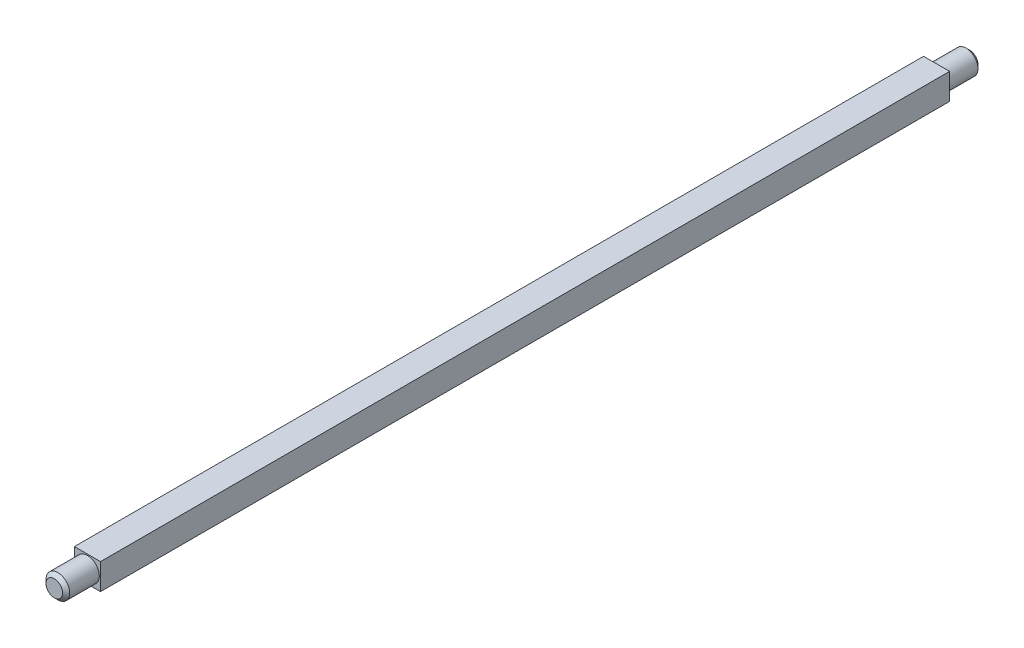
ISO-10303-21;
HEADER;
FILE_DESCRIPTION(('STEP AP214'),'2;1');
FILE_NAME('part.step','',(''),(''),'','','');
FILE_SCHEMA(('AUTOMOTIVE_DESIGN { 1 0 10303 214 1 1 1 1 }'));
ENDSEC;
DATA;
#1=APPLICATION_CONTEXT('core data for automotive mechanical design processes');
#2=APPLICATION_PROTOCOL_DEFINITION('international standard','automotive_design',2000,#1);
#3=PRODUCT_CONTEXT('',#1,'mechanical');
#4=PRODUCT('Part','Part','',(#3));
#5=PRODUCT_RELATED_PRODUCT_CATEGORY('part','',(#4));
#6=PRODUCT_DEFINITION_FORMATION('','',#4);
#7=PRODUCT_DEFINITION_CONTEXT('part definition',#1,'design');
#8=PRODUCT_DEFINITION('design','',#6,#7);
#9=PRODUCT_DEFINITION_SHAPE('','',#8);
#10=(LENGTH_UNIT() NAMED_UNIT(*) SI_UNIT(.MILLI.,.METRE.));
#11=(NAMED_UNIT(*) PLANE_ANGLE_UNIT() SI_UNIT($,.RADIAN.));
#12=(NAMED_UNIT(*) SI_UNIT($,.STERADIAN.) SOLID_ANGLE_UNIT());
#13=UNCERTAINTY_MEASURE_WITH_UNIT(LENGTH_MEASURE(1.E-05),#10,'distance_accuracy_value','');
#14=(GEOMETRIC_REPRESENTATION_CONTEXT(3) GLOBAL_UNCERTAINTY_ASSIGNED_CONTEXT((#13)) GLOBAL_UNIT_ASSIGNED_CONTEXT((#10,
#11,#12)) REPRESENTATION_CONTEXT('',''));
#15=CARTESIAN_POINT('',(0.,0.,0.));
#16=DIRECTION('',(0.,0.,1.));
#17=DIRECTION('',(1.,0.,0.));
#18=AXIS2_PLACEMENT_3D('',#15,#16,#17);
#19=CARTESIAN_POINT('',(5.5,-5.5,-179.25));
#20=DIRECTION('',(1.,0.,0.));
#21=DIRECTION('',(0.,0.,-1.));
#22=AXIS2_PLACEMENT_3D('',#19,#20,#21);
#23=PLANE('',#22);
#24=DIRECTION('',(0.,0.,1.));
#25=VECTOR('',#24,1.);
#26=CARTESIAN_POINT('',(5.5,5.5,-179.25));
#27=LINE('',#26,#25);
#28=CARTESIAN_POINT('',(5.5,5.5,-179.25));
#29=VERTEX_POINT('',#28);
#30=CARTESIAN_POINT('',(5.5,5.5,179.25));
#31=VERTEX_POINT('',#30);
#32=EDGE_CURVE('E89',#29,#31,#27,.T.);
#33=ORIENTED_EDGE('',*,*,#32,.T.);
#34=DIRECTION('',(0.,1.,0.));
#35=VECTOR('',#34,1.);
#36=CARTESIAN_POINT('',(5.5,-5.5,179.25));
#37=LINE('',#36,#35);
#38=CARTESIAN_POINT('',(5.5,-5.5,179.25));
#39=VERTEX_POINT('',#38);
#40=EDGE_CURVE('E92',#39,#31,#37,.T.);
#41=ORIENTED_EDGE('',*,*,#40,.F.);
#42=DIRECTION('',(0.,0.,1.));
#43=VECTOR('',#42,1.);
#44=CARTESIAN_POINT('',(5.5,-5.5,-179.25));
#45=LINE('',#44,#43);
#46=CARTESIAN_POINT('',(5.5,-5.5,-179.25));
#47=VERTEX_POINT('',#46);
#48=EDGE_CURVE('E64',#47,#39,#45,.T.);
#49=ORIENTED_EDGE('',*,*,#48,.F.);
#50=DIRECTION('',(0.,1.,0.));
#51=VECTOR('',#50,1.);
#52=CARTESIAN_POINT('',(5.5,-5.5,-179.25));
#53=LINE('',#52,#51);
#54=EDGE_CURVE('E93',#47,#29,#53,.T.);
#55=ORIENTED_EDGE('',*,*,#54,.T.);
#56=EDGE_LOOP('',(#33,#41,#49,#55));
#57=FACE_BOUND('',#56,.T.);
#58=ADVANCED_FACE('F49',(#57),#23,.T.);
#59=CARTESIAN_POINT('',(-5.5,-5.5,-179.25));
#60=DIRECTION('',(0.,-1.,0.));
#61=DIRECTION('',(0.,0.,-1.));
#62=AXIS2_PLACEMENT_3D('',#59,#60,#61);
#63=PLANE('',#62);
#64=ORIENTED_EDGE('',*,*,#48,.T.);
#65=DIRECTION('',(1.,0.,0.));
#66=VECTOR('',#65,1.);
#67=CARTESIAN_POINT('',(-5.5,-5.5,179.25));
#68=LINE('',#67,#66);
#69=CARTESIAN_POINT('',(-5.5,-5.5,179.25));
#70=VERTEX_POINT('',#69);
#71=EDGE_CURVE('E110',#70,#39,#68,.T.);
#72=ORIENTED_EDGE('',*,*,#71,.F.);
#73=DIRECTION('',(0.,0.,1.));
#74=VECTOR('',#73,1.);
#75=CARTESIAN_POINT('',(-5.5,-5.5,-179.25));
#76=LINE('',#75,#74);
#77=CARTESIAN_POINT('',(-5.5,-5.5,-179.25));
#78=VERTEX_POINT('',#77);
#79=EDGE_CURVE('E72',#78,#70,#76,.T.);
#80=ORIENTED_EDGE('',*,*,#79,.F.);
#81=DIRECTION('',(1.,0.,0.));
#82=VECTOR('',#81,1.);
#83=CARTESIAN_POINT('',(-5.5,-5.5,-179.25));
#84=LINE('',#83,#82);
#85=EDGE_CURVE('E98',#78,#47,#84,.T.);
#86=ORIENTED_EDGE('',*,*,#85,.T.);
#87=EDGE_LOOP('',(#64,#72,#80,#86));
#88=FACE_BOUND('',#87,.T.);
#89=ADVANCED_FACE('F151',(#88),#63,.T.);
#90=CARTESIAN_POINT('',(-5.5,-5.5,-179.25));
#91=DIRECTION('',(-1.,0.,0.));
#92=DIRECTION('',(0.,0.,1.));
#93=AXIS2_PLACEMENT_3D('',#90,#91,#92);
#94=PLANE('',#93);
#95=ORIENTED_EDGE('',*,*,#79,.T.);
#96=DIRECTION('',(0.,-1.,0.));
#97=VECTOR('',#96,1.);
#98=CARTESIAN_POINT('',(-5.5,-5.5,179.25));
#99=LINE('',#98,#97);
#100=CARTESIAN_POINT('',(-5.5,5.5,179.25));
#101=VERTEX_POINT('',#100);
#102=EDGE_CURVE('E106',#101,#70,#99,.T.);
#103=ORIENTED_EDGE('',*,*,#102,.F.);
#104=DIRECTION('',(0.,0.,1.));
#105=VECTOR('',#104,1.);
#106=CARTESIAN_POINT('',(-5.5,5.5,-179.25));
#107=LINE('',#106,#105);
#108=CARTESIAN_POINT('',(-5.5,5.5,-179.25));
#109=VERTEX_POINT('',#108);
#110=EDGE_CURVE('E97',#109,#101,#107,.T.);
#111=ORIENTED_EDGE('',*,*,#110,.F.);
#112=DIRECTION('',(0.,-1.,0.));
#113=VECTOR('',#112,1.);
#114=CARTESIAN_POINT('',(-5.5,-5.5,-179.25));
#115=LINE('',#114,#113);
#116=EDGE_CURVE('E118',#109,#78,#115,.T.);
#117=ORIENTED_EDGE('',*,*,#116,.T.);
#118=EDGE_LOOP('',(#95,#103,#111,#117));
#119=FACE_BOUND('',#118,.T.);
#120=ADVANCED_FACE('F156',(#119),#94,.T.);
#121=CARTESIAN_POINT('',(-5.5,5.5,-179.25));
#122=DIRECTION('',(0.,1.,0.));
#123=DIRECTION('',(0.,0.,1.));
#124=AXIS2_PLACEMENT_3D('',#121,#122,#123);
#125=PLANE('',#124);
#126=ORIENTED_EDGE('',*,*,#110,.T.);
#127=DIRECTION('',(-1.,0.,0.));
#128=VECTOR('',#127,1.);
#129=CARTESIAN_POINT('',(-5.5,5.5,179.25));
#130=LINE('',#129,#128);
#131=EDGE_CURVE('E101',#31,#101,#130,.T.);
#132=ORIENTED_EDGE('',*,*,#131,.F.);
#133=ORIENTED_EDGE('',*,*,#32,.F.);
#134=DIRECTION('',(-1.,0.,0.));
#135=VECTOR('',#134,1.);
#136=CARTESIAN_POINT('',(-5.5,5.5,-179.25));
#137=LINE('',#136,#135);
#138=EDGE_CURVE('E116',#29,#109,#137,.T.);
#139=ORIENTED_EDGE('',*,*,#138,.T.);
#140=EDGE_LOOP('',(#126,#132,#133,#139));
#141=FACE_BOUND('',#140,.T.);
#142=ADVANCED_FACE('F102',(#141),#125,.T.);
#143=CARTESIAN_POINT('',(0.,0.,-179.25));
#144=DIRECTION('',(0.,0.,-1.));
#145=DIRECTION('',(-1.,0.,0.));
#146=AXIS2_PLACEMENT_3D('',#143,#144,#145);
#147=PLANE('',#146);
#148=CARTESIAN_POINT('',(0.,0.,-179.25));
#149=DIRECTION('',(0.,0.,-1.));
#150=DIRECTION('',(-1.,0.,0.));
#151=AXIS2_PLACEMENT_3D('',#148,#149,#150);
#152=CIRCLE('',#151,5.);
#153=CARTESIAN_POINT('',(-5.,0.,-179.25));
#154=VERTEX_POINT('',#153);
#155=EDGE_CURVE('E133',#154,#154,#152,.T.);
#156=ORIENTED_EDGE('',*,*,#155,.F.);
#157=EDGE_LOOP('',(#156));
#158=FACE_BOUND('',#157,.T.);
#159=ORIENTED_EDGE('',*,*,#54,.F.);
#160=ORIENTED_EDGE('',*,*,#85,.F.);
#161=ORIENTED_EDGE('',*,*,#116,.F.);
#162=ORIENTED_EDGE('',*,*,#138,.F.);
#163=EDGE_LOOP('',(#159,#160,#161,#162));
#164=FACE_BOUND('',#163,.T.);
#165=ADVANCED_FACE('F182',(#158,#164),#147,.T.);
#166=CARTESIAN_POINT('',(0.,0.,179.25));
#167=DIRECTION('',(0.,0.,-1.));
#168=DIRECTION('',(-1.,0.,0.));
#169=AXIS2_PLACEMENT_3D('',#166,#167,#168);
#170=PLANE('',#169);
#171=CARTESIAN_POINT('',(0.,0.,179.25));
#172=DIRECTION('',(0.,0.,-1.));
#173=DIRECTION('',(-1.,0.,0.));
#174=AXIS2_PLACEMENT_3D('',#171,#172,#173);
#175=CIRCLE('',#174,5.);
#176=CARTESIAN_POINT('',(-5.,0.,179.25));
#177=VERTEX_POINT('',#176);
#178=EDGE_CURVE('E122',#177,#177,#175,.F.);
#179=ORIENTED_EDGE('',*,*,#178,.F.);
#180=EDGE_LOOP('',(#179));
#181=FACE_BOUND('',#180,.T.);
#182=ORIENTED_EDGE('',*,*,#40,.T.);
#183=ORIENTED_EDGE('',*,*,#131,.T.);
#184=ORIENTED_EDGE('',*,*,#102,.T.);
#185=ORIENTED_EDGE('',*,*,#71,.T.);
#186=EDGE_LOOP('',(#182,#183,#184,#185));
#187=FACE_BOUND('',#186,.T.);
#188=ADVANCED_FACE('F109',(#181,#187),#170,.F.);
#189=CARTESIAN_POINT('',(0.,0.,193.25));
#190=DIRECTION('',(0.,0.,-1.));
#191=DIRECTION('',(-1.,0.,0.));
#192=AXIS2_PLACEMENT_3D('',#189,#190,#191);
#193=CYLINDRICAL_SURFACE('',#192,5.);
#194=CARTESIAN_POINT('',(0.,0.,191.75));
#195=DIRECTION('',(0.,0.,1.));
#196=DIRECTION('',(1.,0.,0.));
#197=AXIS2_PLACEMENT_3D('',#194,#195,#196);
#198=CIRCLE('',#197,5.);
#199=CARTESIAN_POINT('',(5.,0.,191.75));
#200=VERTEX_POINT('',#199);
#201=EDGE_CURVE('E130',#200,#200,#198,.F.);
#202=ORIENTED_EDGE('',*,*,#201,.T.);
#203=EDGE_LOOP('',(#202));
#204=FACE_BOUND('',#203,.T.);
#205=ORIENTED_EDGE('',*,*,#178,.T.);
#206=EDGE_LOOP('',(#205));
#207=FACE_BOUND('',#206,.T.);
#208=ADVANCED_FACE('F169',(#204,#207),#193,.T.);
#209=CARTESIAN_POINT('',(0.,0.,193.25));
#210=DIRECTION('',(0.,0.,1.));
#211=DIRECTION('',(1.,0.,0.));
#212=AXIS2_PLACEMENT_3D('',#209,#210,#211);
#213=PLANE('',#212);
#214=CARTESIAN_POINT('',(0.,0.,193.25));
#215=DIRECTION('',(0.,0.,1.));
#216=DIRECTION('',(1.,0.,0.));
#217=AXIS2_PLACEMENT_3D('',#214,#215,#216);
#218=CIRCLE('',#217,3.5);
#219=CARTESIAN_POINT('',(3.5,0.,193.25));
#220=VERTEX_POINT('',#219);
#221=EDGE_CURVE('E127',#220,#220,#218,.T.);
#222=ORIENTED_EDGE('',*,*,#221,.T.);
#223=EDGE_LOOP('',(#222));
#224=FACE_BOUND('',#223,.T.);
#225=ADVANCED_FACE('F162',(#224),#213,.T.);
#226=CARTESIAN_POINT('',(0.,0.,193.25));
#227=DIRECTION('',(0.,0.,-1.));
#228=DIRECTION('',(-1.,0.,0.));
#229=AXIS2_PLACEMENT_3D('',#226,#227,#228);
#230=CONICAL_SURFACE('',#229,3.5,0.785398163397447);
#231=ORIENTED_EDGE('',*,*,#201,.F.);
#232=EDGE_LOOP('',(#231));
#233=FACE_BOUND('',#232,.T.);
#234=ORIENTED_EDGE('',*,*,#221,.F.);
#235=EDGE_LOOP('',(#234));
#236=FACE_BOUND('',#235,.T.);
#237=ADVANCED_FACE('F160',(#233,#236),#230,.T.);
#238=CARTESIAN_POINT('',(0.,0.,-193.25));
#239=DIRECTION('',(0.,0.,1.));
#240=DIRECTION('',(1.,0.,0.));
#241=AXIS2_PLACEMENT_3D('',#238,#239,#240);
#242=CYLINDRICAL_SURFACE('',#241,5.);
#243=CARTESIAN_POINT('',(0.,0.,-191.75));
#244=DIRECTION('',(0.,0.,-1.));
#245=DIRECTION('',(-1.,0.,0.));
#246=AXIS2_PLACEMENT_3D('',#243,#244,#245);
#247=CIRCLE('',#246,5.);
#248=CARTESIAN_POINT('',(-5.,0.,-191.75));
#249=VERTEX_POINT('',#248);
#250=EDGE_CURVE('E57',#249,#249,#247,.F.);
#251=ORIENTED_EDGE('',*,*,#250,.T.);
#252=EDGE_LOOP('',(#251));
#253=FACE_BOUND('',#252,.T.);
#254=ORIENTED_EDGE('',*,*,#155,.T.);
#255=EDGE_LOOP('',(#254));
#256=FACE_BOUND('',#255,.T.);
#257=ADVANCED_FACE('F138',(#253,#256),#242,.T.);
#258=CARTESIAN_POINT('',(0.,0.,-193.25));
#259=DIRECTION('',(0.,0.,-1.));
#260=DIRECTION('',(1.,0.,0.));
#261=AXIS2_PLACEMENT_3D('',#258,#259,#260);
#262=PLANE('',#261);
#263=CARTESIAN_POINT('',(0.,0.,-193.25));
#264=DIRECTION('',(0.,0.,-1.));
#265=DIRECTION('',(-1.,0.,0.));
#266=AXIS2_PLACEMENT_3D('',#263,#264,#265);
#267=CIRCLE('',#266,3.49999999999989);
#268=CARTESIAN_POINT('',(-3.49999999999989,0.,-193.25));
#269=VERTEX_POINT('',#268);
#270=EDGE_CURVE('E13',#269,#269,#267,.T.);
#271=ORIENTED_EDGE('',*,*,#270,.T.);
#272=EDGE_LOOP('',(#271));
#273=FACE_BOUND('',#272,.T.);
#274=ADVANCED_FACE('F142',(#273),#262,.T.);
#275=CARTESIAN_POINT('',(0.,0.,-191.75));
#276=DIRECTION('',(0.,0.,1.));
#277=DIRECTION('',(1.,0.,0.));
#278=AXIS2_PLACEMENT_3D('',#275,#276,#277);
#279=CONICAL_SURFACE('',#278,5.,0.785398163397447);
#280=ORIENTED_EDGE('',*,*,#270,.F.);
#281=EDGE_LOOP('',(#280));
#282=FACE_BOUND('',#281,.T.);
#283=ORIENTED_EDGE('',*,*,#250,.F.);
#284=EDGE_LOOP('',(#283));
#285=FACE_BOUND('',#284,.T.);
#286=ADVANCED_FACE('F51',(#282,#285),#279,.T.);
#287=CLOSED_SHELL('',(#58,#89,#120,#142,#165,#188,#208,#225,#237,#257,#274,#286));
#288=MANIFOLD_SOLID_BREP('B2',#287);
#289=ADVANCED_BREP_SHAPE_REPRESENTATION('',(#18,#288),#14);
#290=SHAPE_DEFINITION_REPRESENTATION(#9,#289);
ENDSEC;
END-ISO-10303-21;
